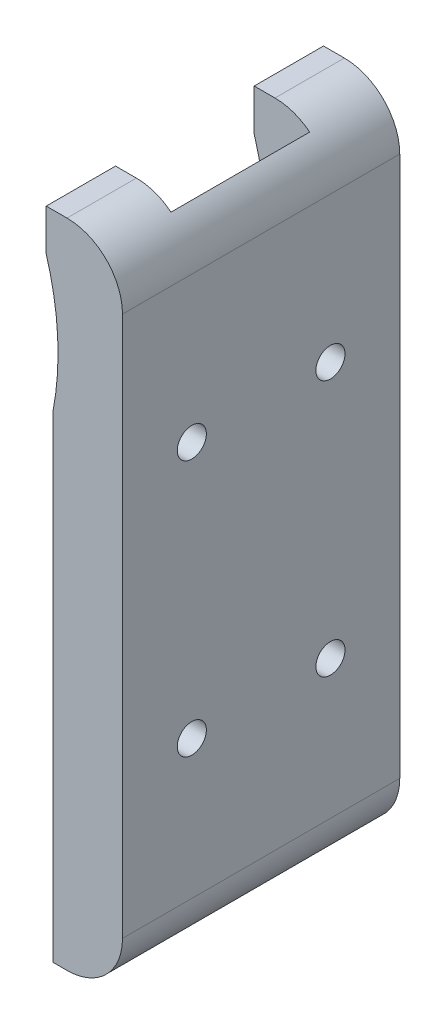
ISO-10303-21;
HEADER;
FILE_DESCRIPTION(('STEP AP214'),'2;1');
FILE_NAME('part.step','',(''),(''),'','','');
FILE_SCHEMA(('AUTOMOTIVE_DESIGN { 1 0 10303 214 1 1 1 1 }'));
ENDSEC;
DATA;
#1=APPLICATION_CONTEXT('core data for automotive mechanical design processes');
#2=APPLICATION_PROTOCOL_DEFINITION('international standard','automotive_design',2000,#1);
#3=PRODUCT_CONTEXT('',#1,'mechanical');
#4=PRODUCT('Part','Part','',(#3));
#5=PRODUCT_RELATED_PRODUCT_CATEGORY('part','',(#4));
#6=PRODUCT_DEFINITION_FORMATION('','',#4);
#7=PRODUCT_DEFINITION_CONTEXT('part definition',#1,'design');
#8=PRODUCT_DEFINITION('design','',#6,#7);
#9=PRODUCT_DEFINITION_SHAPE('','',#8);
#10=(LENGTH_UNIT() NAMED_UNIT(*) SI_UNIT(.MILLI.,.METRE.));
#11=(NAMED_UNIT(*) PLANE_ANGLE_UNIT() SI_UNIT($,.RADIAN.));
#12=(NAMED_UNIT(*) SI_UNIT($,.STERADIAN.) SOLID_ANGLE_UNIT());
#13=UNCERTAINTY_MEASURE_WITH_UNIT(LENGTH_MEASURE(1.E-05),#10,'distance_accuracy_value','');
#14=(GEOMETRIC_REPRESENTATION_CONTEXT(3) GLOBAL_UNCERTAINTY_ASSIGNED_CONTEXT((#13)) GLOBAL_UNIT_ASSIGNED_CONTEXT((#10,
#11,#12)) REPRESENTATION_CONTEXT('',''));
#15=CARTESIAN_POINT('',(0.,0.,0.));
#16=DIRECTION('',(0.,0.,1.));
#17=DIRECTION('',(1.,0.,0.));
#18=AXIS2_PLACEMENT_3D('',#15,#16,#17);
#19=CARTESIAN_POINT('',(17.,95.,10.));
#20=DIRECTION('',(0.,0.,1.));
#21=DIRECTION('',(0.,-1.,0.));
#22=AXIS2_PLACEMENT_3D('',#19,#20,#21);
#23=PLANE('',#22);
#24=DIRECTION('',(0.,1.,0.));
#25=VECTOR('',#24,1.);
#26=CARTESIAN_POINT('',(10.,164.,10.));
#27=LINE('',#26,#25);
#28=CARTESIAN_POINT('',(10.,95.,10.));
#29=VERTEX_POINT('',#28);
#30=CARTESIAN_POINT('',(10.,120.9,10.));
#31=VERTEX_POINT('',#30);
#32=EDGE_CURVE('E531',#29,#31,#27,.T.);
#33=ORIENTED_EDGE('',*,*,#32,.T.);
#34=DIRECTION('',(1.,0.,0.));
#35=VECTOR('',#34,1.);
#36=CARTESIAN_POINT('',(20.,120.9,10.));
#37=LINE('',#36,#35);
#38=CARTESIAN_POINT('',(17.,120.9,10.));
#39=VERTEX_POINT('',#38);
#40=EDGE_CURVE('E520',#31,#39,#37,.T.);
#41=ORIENTED_EDGE('',*,*,#40,.T.);
#42=DIRECTION('',(0.,1.,0.));
#43=VECTOR('',#42,1.);
#44=CARTESIAN_POINT('',(17.,95.,10.));
#45=LINE('',#44,#43);
#46=CARTESIAN_POINT('',(17.,96.7550020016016,10.));
#47=VERTEX_POINT('',#46);
#48=EDGE_CURVE('E528',#47,#39,#45,.T.);
#49=ORIENTED_EDGE('',*,*,#48,.F.);
#50=CARTESIAN_POINT('',(12.,103.,10.));
#51=DIRECTION('',(0.,0.,1.));
#52=DIRECTION('',(0.,-1.,0.));
#53=AXIS2_PLACEMENT_3D('',#50,#51,#52);
#54=CIRCLE('',#53,8.00000000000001);
#55=CARTESIAN_POINT('',(12.,95.,10.));
#56=VERTEX_POINT('',#55);
#57=EDGE_CURVE('E716',#47,#56,#54,.F.);
#58=ORIENTED_EDGE('',*,*,#57,.T.);
#59=DIRECTION('',(-1.,0.,0.));
#60=VECTOR('',#59,1.);
#61=CARTESIAN_POINT('',(12.,95.,10.));
#62=LINE('',#61,#60);
#63=EDGE_CURVE('E677',#56,#29,#62,.T.);
#64=ORIENTED_EDGE('',*,*,#63,.T.);
#65=EDGE_LOOP('',(#33,#41,#49,#58,#64));
#66=FACE_BOUND('',#65,.T.);
#67=ADVANCED_FACE('F359',(#66),#23,.F.);
#68=CARTESIAN_POINT('',(17.,125.1,10.));
#69=VERTEX_POINT('',#68);
#70=CARTESIAN_POINT('',(17.,157.9,10.));
#71=VERTEX_POINT('',#70);
#72=EDGE_CURVE('E538',#69,#71,#45,.T.);
#73=ORIENTED_EDGE('',*,*,#72,.F.);
#74=DIRECTION('',(1.,0.,0.));
#75=VECTOR('',#74,1.);
#76=CARTESIAN_POINT('',(20.,125.1,10.));
#77=LINE('',#76,#75);
#78=CARTESIAN_POINT('',(10.,125.1,10.));
#79=VERTEX_POINT('',#78);
#80=EDGE_CURVE('E374',#69,#79,#77,.F.);
#81=ORIENTED_EDGE('',*,*,#80,.T.);
#82=CARTESIAN_POINT('',(10.,157.9,10.));
#83=VERTEX_POINT('',#82);
#84=EDGE_CURVE('E734',#79,#83,#27,.T.);
#85=ORIENTED_EDGE('',*,*,#84,.T.);
#86=DIRECTION('',(1.,0.,0.));
#87=VECTOR('',#86,1.);
#88=CARTESIAN_POINT('',(20.,157.9,10.));
#89=LINE('',#88,#87);
#90=EDGE_CURVE('E588',#83,#71,#89,.T.);
#91=ORIENTED_EDGE('',*,*,#90,.T.);
#92=EDGE_LOOP('',(#73,#81,#85,#91));
#93=FACE_BOUND('',#92,.T.);
#94=ADVANCED_FACE('F806',(#93),#23,.F.);
#95=CARTESIAN_POINT('',(17.,95.,-9.99999999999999));
#96=DIRECTION('',(0.,0.,-1.));
#97=DIRECTION('',(0.,1.,0.));
#98=AXIS2_PLACEMENT_3D('',#95,#96,#97);
#99=PLANE('',#98);
#100=DIRECTION('',(0.,-1.,0.));
#101=VECTOR('',#100,1.);
#102=CARTESIAN_POINT('',(10.,164.,-10.));
#103=LINE('',#102,#101);
#104=CARTESIAN_POINT('',(9.99999999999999,164.,-10.));
#105=VERTEX_POINT('',#104);
#106=CARTESIAN_POINT('',(10.,162.1,-10.));
#107=VERTEX_POINT('',#106);
#108=EDGE_CURVE('E721',#105,#107,#103,.T.);
#109=ORIENTED_EDGE('',*,*,#108,.T.);
#110=DIRECTION('',(1.,0.,0.));
#111=VECTOR('',#110,1.);
#112=CARTESIAN_POINT('',(20.,162.1,-10.));
#113=LINE('',#112,#111);
#114=CARTESIAN_POINT('',(17.,162.1,-10.));
#115=VERTEX_POINT('',#114);
#116=EDGE_CURVE('E577',#107,#115,#113,.T.);
#117=ORIENTED_EDGE('',*,*,#116,.T.);
#118=DIRECTION('',(0.,-1.,0.));
#119=VECTOR('',#118,1.);
#120=CARTESIAN_POINT('',(17.,95.,-9.99999999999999));
#121=LINE('',#120,#119);
#122=CARTESIAN_POINT('',(17.,187.244997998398,-10.));
#123=VERTEX_POINT('',#122);
#124=EDGE_CURVE('E546',#123,#115,#121,.T.);
#125=ORIENTED_EDGE('',*,*,#124,.F.);
#126=CARTESIAN_POINT('',(12.,181.,-10.));
#127=DIRECTION('',(0.,0.,-1.));
#128=DIRECTION('',(0.,1.,0.));
#129=AXIS2_PLACEMENT_3D('',#126,#127,#128);
#130=CIRCLE('',#129,8.00000000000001);
#131=CARTESIAN_POINT('',(12.,189.,-10.));
#132=VERTEX_POINT('',#131);
#133=EDGE_CURVE('E720',#123,#132,#130,.F.);
#134=ORIENTED_EDGE('',*,*,#133,.T.);
#135=DIRECTION('',(-1.,0.,0.));
#136=VECTOR('',#135,1.);
#137=CARTESIAN_POINT('',(17.,189.,-10.));
#138=LINE('',#137,#136);
#139=CARTESIAN_POINT('',(9.00000000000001,189.,-10.));
#140=VERTEX_POINT('',#139);
#141=EDGE_CURVE('E542',#132,#140,#138,.T.);
#142=ORIENTED_EDGE('',*,*,#141,.T.);
#143=DIRECTION('',(0.,-1.,0.));
#144=VECTOR('',#143,1.);
#145=CARTESIAN_POINT('',(9.00000000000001,95.,-9.99999999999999));
#146=LINE('',#145,#144);
#147=CARTESIAN_POINT('',(9.00000000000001,183.,-10.));
#148=VERTEX_POINT('',#147);
#149=EDGE_CURVE('E559',#140,#148,#146,.T.);
#150=ORIENTED_EDGE('',*,*,#149,.T.);
#151=CARTESIAN_POINT('',(-29.2985838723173,171.457969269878,-10.));
#152=DIRECTION('',(0.,0.,-1.));
#153=DIRECTION('',(0.,1.,0.));
#154=AXIS2_PLACEMENT_3D('',#151,#152,#153);
#155=CIRCLE('',#154,40.);
#156=EDGE_CURVE('E728',#148,#105,#155,.T.);
#157=ORIENTED_EDGE('',*,*,#156,.T.);
#158=EDGE_LOOP('',(#109,#117,#125,#134,#142,#150,#157));
#159=FACE_BOUND('',#158,.T.);
#160=ADVANCED_FACE('F740',(#159),#99,.F.);
#161=CARTESIAN_POINT('',(17.,157.9,-10.));
#162=VERTEX_POINT('',#161);
#163=CARTESIAN_POINT('',(17.,125.1,-9.99999999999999));
#164=VERTEX_POINT('',#163);
#165=EDGE_CURVE('E550',#162,#164,#121,.T.);
#166=ORIENTED_EDGE('',*,*,#165,.F.);
#167=DIRECTION('',(1.,0.,0.));
#168=VECTOR('',#167,1.);
#169=CARTESIAN_POINT('',(20.,157.9,-10.));
#170=LINE('',#169,#168);
#171=CARTESIAN_POINT('',(10.,157.9,-10.));
#172=VERTEX_POINT('',#171);
#173=EDGE_CURVE('E580',#162,#172,#170,.F.);
#174=ORIENTED_EDGE('',*,*,#173,.T.);
#175=CARTESIAN_POINT('',(10.,125.1,-9.99999999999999));
#176=VERTEX_POINT('',#175);
#177=EDGE_CURVE('E724',#172,#176,#103,.T.);
#178=ORIENTED_EDGE('',*,*,#177,.T.);
#179=DIRECTION('',(1.,0.,0.));
#180=VECTOR('',#179,1.);
#181=CARTESIAN_POINT('',(20.,125.1,-9.99999999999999));
#182=LINE('',#181,#180);
#183=EDGE_CURVE('E566',#176,#164,#182,.T.);
#184=ORIENTED_EDGE('',*,*,#183,.T.);
#185=EDGE_LOOP('',(#166,#174,#178,#184));
#186=FACE_BOUND('',#185,.T.);
#187=ADVANCED_FACE('F799',(#186),#99,.F.);
#188=CARTESIAN_POINT('',(10.,164.,-20.));
#189=DIRECTION('',(-1.,0.,0.));
#190=DIRECTION('',(0.,-1.,0.));
#191=AXIS2_PLACEMENT_3D('',#188,#189,#190);
#192=PLANE('',#191);
#193=CARTESIAN_POINT('',(10.,160.,-10.));
#194=DIRECTION('',(-1.,0.,0.));
#195=DIRECTION('',(0.,-1.,0.));
#196=AXIS2_PLACEMENT_3D('',#193,#194,#195);
#197=CIRCLE('',#196,2.09999999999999);
#198=EDGE_CURVE('E575',#107,#172,#197,.T.);
#199=ORIENTED_EDGE('',*,*,#198,.F.);
#200=ORIENTED_EDGE('',*,*,#108,.F.);
#201=DIRECTION('',(0.,0.,1.));
#202=VECTOR('',#201,1.);
#203=CARTESIAN_POINT('',(10.,164.,-20.));
#204=LINE('',#203,#202);
#205=CARTESIAN_POINT('',(10.,164.,-20.));
#206=VERTEX_POINT('',#205);
#207=EDGE_CURVE('E674',#206,#105,#204,.T.);
#208=ORIENTED_EDGE('',*,*,#207,.F.);
#209=DIRECTION('',(0.,-1.,0.));
#210=VECTOR('',#209,1.);
#211=CARTESIAN_POINT('',(10.,164.,-20.));
#212=LINE('',#211,#210);
#213=CARTESIAN_POINT('',(10.,95.,-20.));
#214=VERTEX_POINT('',#213);
#215=EDGE_CURVE('E650',#206,#214,#212,.T.);
#216=ORIENTED_EDGE('',*,*,#215,.T.);
#217=DIRECTION('',(0.,0.,1.));
#218=VECTOR('',#217,1.);
#219=CARTESIAN_POINT('',(10.,95.,-20.));
#220=LINE('',#219,#218);
#221=CARTESIAN_POINT('',(10.,95.,-9.99999999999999));
#222=VERTEX_POINT('',#221);
#223=EDGE_CURVE('E697',#214,#222,#220,.T.);
#224=ORIENTED_EDGE('',*,*,#223,.T.);
#225=CARTESIAN_POINT('',(10.,120.9,-9.99999999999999));
#226=VERTEX_POINT('',#225);
#227=EDGE_CURVE('E726',#226,#222,#103,.T.);
#228=ORIENTED_EDGE('',*,*,#227,.F.);
#229=CARTESIAN_POINT('',(10.,123.,-10.));
#230=DIRECTION('',(-1.,0.,0.));
#231=DIRECTION('',(0.,-1.,0.));
#232=AXIS2_PLACEMENT_3D('',#229,#230,#231);
#233=CIRCLE('',#232,2.09999999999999);
#234=EDGE_CURVE('E562',#176,#226,#233,.T.);
#235=ORIENTED_EDGE('',*,*,#234,.F.);
#236=ORIENTED_EDGE('',*,*,#177,.F.);
#237=EDGE_LOOP('',(#199,#200,#208,#216,#224,#228,#235,#236));
#238=FACE_BOUND('',#237,.T.);
#239=ADVANCED_FACE('F781',(#238),#192,.T.);
#240=CARTESIAN_POINT('',(-29.2985838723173,171.457969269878,-20.));
#241=DIRECTION('',(0.,0.,1.));
#242=DIRECTION('',(1.,0.,0.));
#243=AXIS2_PLACEMENT_3D('',#240,#241,#242);
#244=CYLINDRICAL_SURFACE('',#243,40.);
#245=ORIENTED_EDGE('',*,*,#156,.F.);
#246=DIRECTION('',(0.,0.,1.));
#247=VECTOR('',#246,1.);
#248=CARTESIAN_POINT('',(9.00000000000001,183.,-20.));
#249=LINE('',#248,#247);
#250=CARTESIAN_POINT('',(9.00000000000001,183.,-20.));
#251=VERTEX_POINT('',#250);
#252=EDGE_CURVE('E679',#251,#148,#249,.T.);
#253=ORIENTED_EDGE('',*,*,#252,.F.);
#254=CARTESIAN_POINT('',(-29.2985838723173,171.457969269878,-20.));
#255=DIRECTION('',(0.,0.,-1.));
#256=DIRECTION('',(1.,0.,0.));
#257=AXIS2_PLACEMENT_3D('',#254,#255,#256);
#258=CIRCLE('',#257,40.);
#259=EDGE_CURVE('E670',#251,#206,#258,.T.);
#260=ORIENTED_EDGE('',*,*,#259,.T.);
#261=ORIENTED_EDGE('',*,*,#207,.T.);
#262=EDGE_LOOP('',(#245,#253,#260,#261));
#263=FACE_BOUND('',#262,.T.);
#264=ADVANCED_FACE('F785',(#263),#244,.F.);
#265=CARTESIAN_POINT('',(9.00000000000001,189.,-20.));
#266=DIRECTION('',(-1.,0.,0.));
#267=DIRECTION('',(0.,0.,1.));
#268=AXIS2_PLACEMENT_3D('',#265,#266,#267);
#269=PLANE('',#268);
#270=ORIENTED_EDGE('',*,*,#149,.F.);
#271=DIRECTION('',(0.,0.,1.));
#272=VECTOR('',#271,1.);
#273=CARTESIAN_POINT('',(9.00000000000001,189.,-20.));
#274=LINE('',#273,#272);
#275=CARTESIAN_POINT('',(9.00000000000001,189.,-20.));
#276=VERTEX_POINT('',#275);
#277=EDGE_CURVE('E683',#276,#140,#274,.T.);
#278=ORIENTED_EDGE('',*,*,#277,.F.);
#279=DIRECTION('',(0.,-1.,0.));
#280=VECTOR('',#279,1.);
#281=CARTESIAN_POINT('',(9.00000000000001,189.,-20.));
#282=LINE('',#281,#280);
#283=EDGE_CURVE('E667',#276,#251,#282,.T.);
#284=ORIENTED_EDGE('',*,*,#283,.T.);
#285=ORIENTED_EDGE('',*,*,#252,.T.);
#286=EDGE_LOOP('',(#270,#278,#284,#285));
#287=FACE_BOUND('',#286,.T.);
#288=ADVANCED_FACE('F744',(#287),#269,.T.);
#289=CARTESIAN_POINT('',(12.,189.,-20.));
#290=DIRECTION('',(0.,1.,0.));
#291=DIRECTION('',(0.,0.,1.));
#292=AXIS2_PLACEMENT_3D('',#289,#290,#291);
#293=PLANE('',#292);
#294=ORIENTED_EDGE('',*,*,#141,.F.);
#295=DIRECTION('',(0.,0.,1.));
#296=VECTOR('',#295,1.);
#297=CARTESIAN_POINT('',(12.,189.,-20.));
#298=LINE('',#297,#296);
#299=CARTESIAN_POINT('',(12.,189.,-20.));
#300=VERTEX_POINT('',#299);
#301=EDGE_CURVE('E687',#300,#132,#298,.T.);
#302=ORIENTED_EDGE('',*,*,#301,.F.);
#303=DIRECTION('',(-1.,0.,0.));
#304=VECTOR('',#303,1.);
#305=CARTESIAN_POINT('',(12.,189.,-20.));
#306=LINE('',#305,#304);
#307=EDGE_CURVE('E664',#300,#276,#306,.T.);
#308=ORIENTED_EDGE('',*,*,#307,.T.);
#309=ORIENTED_EDGE('',*,*,#277,.T.);
#310=EDGE_LOOP('',(#294,#302,#308,#309));
#311=FACE_BOUND('',#310,.T.);
#312=ADVANCED_FACE('F746',(#311),#293,.T.);
#313=CARTESIAN_POINT('',(12.,95.,-20.));
#314=DIRECTION('',(0.,-1.,0.));
#315=DIRECTION('',(0.,0.,-1.));
#316=AXIS2_PLACEMENT_3D('',#313,#314,#315);
#317=PLANE('',#316);
#318=DIRECTION('',(1.,0.,0.));
#319=VECTOR('',#318,1.);
#320=CARTESIAN_POINT('',(12.,95.,-9.99999999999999));
#321=LINE('',#320,#319);
#322=CARTESIAN_POINT('',(12.,95.,-9.99999999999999));
#323=VERTEX_POINT('',#322);
#324=EDGE_CURVE('E701',#222,#323,#321,.T.);
#325=ORIENTED_EDGE('',*,*,#324,.F.);
#326=ORIENTED_EDGE('',*,*,#223,.F.);
#327=DIRECTION('',(1.,0.,0.));
#328=VECTOR('',#327,1.);
#329=CARTESIAN_POINT('',(12.,95.,-20.));
#330=LINE('',#329,#328);
#331=CARTESIAN_POINT('',(12.,95.,-20.));
#332=VERTEX_POINT('',#331);
#333=EDGE_CURVE('E653',#214,#332,#330,.T.);
#334=ORIENTED_EDGE('',*,*,#333,.T.);
#335=DIRECTION('',(0.,0.,1.));
#336=VECTOR('',#335,1.);
#337=CARTESIAN_POINT('',(12.,95.,-20.));
#338=LINE('',#337,#336);
#339=EDGE_CURVE('E693',#332,#323,#338,.T.);
#340=ORIENTED_EDGE('',*,*,#339,.T.);
#341=EDGE_LOOP('',(#325,#326,#334,#340));
#342=FACE_BOUND('',#341,.T.);
#343=ADVANCED_FACE('F777',(#342),#317,.T.);
#344=CARTESIAN_POINT('',(10.,123.,10.));
#345=DIRECTION('',(-1.,0.,0.));
#346=DIRECTION('',(0.,-1.,0.));
#347=AXIS2_PLACEMENT_3D('',#344,#345,#346);
#348=CIRCLE('',#347,2.09999999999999);
#349=EDGE_CURVE('E532',#31,#79,#348,.T.);
#350=ORIENTED_EDGE('',*,*,#349,.F.);
#351=ORIENTED_EDGE('',*,*,#32,.F.);
#352=CARTESIAN_POINT('',(10.,95.,20.));
#353=VERTEX_POINT('',#352);
#354=EDGE_CURVE('E673',#29,#353,#220,.T.);
#355=ORIENTED_EDGE('',*,*,#354,.T.);
#356=DIRECTION('',(0.,-1.,0.));
#357=VECTOR('',#356,1.);
#358=CARTESIAN_POINT('',(10.,164.,20.));
#359=LINE('',#358,#357);
#360=CARTESIAN_POINT('',(10.,164.,20.));
#361=VERTEX_POINT('',#360);
#362=EDGE_CURVE('E636',#361,#353,#359,.T.);
#363=ORIENTED_EDGE('',*,*,#362,.F.);
#364=CARTESIAN_POINT('',(9.99999999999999,164.,10.));
#365=VERTEX_POINT('',#364);
#366=EDGE_CURVE('E678',#365,#361,#204,.T.);
#367=ORIENTED_EDGE('',*,*,#366,.F.);
#368=CARTESIAN_POINT('',(10.,162.1,10.));
#369=VERTEX_POINT('',#368);
#370=EDGE_CURVE('E735',#369,#365,#27,.T.);
#371=ORIENTED_EDGE('',*,*,#370,.F.);
#372=CARTESIAN_POINT('',(10.,160.,10.));
#373=DIRECTION('',(-1.,0.,0.));
#374=DIRECTION('',(0.,-1.,0.));
#375=AXIS2_PLACEMENT_3D('',#372,#373,#374);
#376=CIRCLE('',#375,2.09999999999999);
#377=EDGE_CURVE('E586',#83,#369,#376,.T.);
#378=ORIENTED_EDGE('',*,*,#377,.F.);
#379=ORIENTED_EDGE('',*,*,#84,.F.);
#380=EDGE_LOOP('',(#350,#351,#355,#363,#367,#371,#378,#379));
#381=FACE_BOUND('',#380,.T.);
#382=ADVANCED_FACE('F361',(#381),#192,.T.);
#383=CARTESIAN_POINT('',(-29.2985838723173,171.457969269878,10.));
#384=DIRECTION('',(0.,0.,1.));
#385=DIRECTION('',(0.,-1.,0.));
#386=AXIS2_PLACEMENT_3D('',#383,#384,#385);
#387=CIRCLE('',#386,40.);
#388=CARTESIAN_POINT('',(9.00000000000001,183.,10.));
#389=VERTEX_POINT('',#388);
#390=EDGE_CURVE('E715',#365,#389,#387,.T.);
#391=ORIENTED_EDGE('',*,*,#390,.F.);
#392=ORIENTED_EDGE('',*,*,#366,.T.);
#393=CARTESIAN_POINT('',(-29.2985838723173,171.457969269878,20.));
#394=DIRECTION('',(0.,0.,-1.));
#395=DIRECTION('',(1.,0.,0.));
#396=AXIS2_PLACEMENT_3D('',#393,#394,#395);
#397=CIRCLE('',#396,40.);
#398=CARTESIAN_POINT('',(9.00000000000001,183.,20.));
#399=VERTEX_POINT('',#398);
#400=EDGE_CURVE('E647',#399,#361,#397,.T.);
#401=ORIENTED_EDGE('',*,*,#400,.F.);
#402=EDGE_CURVE('E682',#389,#399,#249,.T.);
#403=ORIENTED_EDGE('',*,*,#402,.F.);
#404=EDGE_LOOP('',(#391,#392,#401,#403));
#405=FACE_BOUND('',#404,.T.);
#406=ADVANCED_FACE('F764',(#405),#244,.F.);
#407=DIRECTION('',(0.,1.,0.));
#408=VECTOR('',#407,1.);
#409=CARTESIAN_POINT('',(9.00000000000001,95.,10.));
#410=LINE('',#409,#408);
#411=CARTESIAN_POINT('',(9.00000000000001,189.,10.));
#412=VERTEX_POINT('',#411);
#413=EDGE_CURVE('E555',#389,#412,#410,.T.);
#414=ORIENTED_EDGE('',*,*,#413,.F.);
#415=ORIENTED_EDGE('',*,*,#402,.T.);
#416=DIRECTION('',(0.,-1.,0.));
#417=VECTOR('',#416,1.);
#418=CARTESIAN_POINT('',(9.00000000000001,189.,20.));
#419=LINE('',#418,#417);
#420=CARTESIAN_POINT('',(9.00000000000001,189.,20.));
#421=VERTEX_POINT('',#420);
#422=EDGE_CURVE('E644',#421,#399,#419,.T.);
#423=ORIENTED_EDGE('',*,*,#422,.F.);
#424=EDGE_CURVE('E686',#412,#421,#274,.T.);
#425=ORIENTED_EDGE('',*,*,#424,.F.);
#426=EDGE_LOOP('',(#414,#415,#423,#425));
#427=FACE_BOUND('',#426,.T.);
#428=ADVANCED_FACE('F760',(#427),#269,.T.);
#429=DIRECTION('',(-1.,0.,0.));
#430=VECTOR('',#429,1.);
#431=CARTESIAN_POINT('',(17.,189.,10.));
#432=LINE('',#431,#430);
#433=CARTESIAN_POINT('',(12.,189.,10.));
#434=VERTEX_POINT('',#433);
#435=EDGE_CURVE('E537',#434,#412,#432,.T.);
#436=ORIENTED_EDGE('',*,*,#435,.T.);
#437=ORIENTED_EDGE('',*,*,#424,.T.);
#438=DIRECTION('',(-1.,0.,0.));
#439=VECTOR('',#438,1.);
#440=CARTESIAN_POINT('',(12.,189.,20.));
#441=LINE('',#440,#439);
#442=CARTESIAN_POINT('',(12.,189.,20.));
#443=VERTEX_POINT('',#442);
#444=EDGE_CURVE('E641',#443,#421,#441,.T.);
#445=ORIENTED_EDGE('',*,*,#444,.F.);
#446=EDGE_CURVE('E690',#434,#443,#298,.T.);
#447=ORIENTED_EDGE('',*,*,#446,.F.);
#448=EDGE_LOOP('',(#436,#437,#445,#447));
#449=FACE_BOUND('',#448,.T.);
#450=ADVANCED_FACE('F757',(#449),#293,.T.);
#451=CARTESIAN_POINT('',(12.,181.,-20.));
#452=DIRECTION('',(0.,0.,1.));
#453=DIRECTION('',(1.,0.,0.));
#454=AXIS2_PLACEMENT_3D('',#451,#452,#453);
#455=CYLINDRICAL_SURFACE('',#454,8.00000000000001);
#456=ORIENTED_EDGE('',*,*,#133,.F.);
#457=DIRECTION('',(0.,0.,1.));
#458=VECTOR('',#457,1.);
#459=CARTESIAN_POINT('',(17.,187.244997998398,-20.));
#460=LINE('',#459,#458);
#461=CARTESIAN_POINT('',(17.,187.244997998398,10.));
#462=VERTEX_POINT('',#461);
#463=EDGE_CURVE('E719',#462,#123,#460,.F.);
#464=ORIENTED_EDGE('',*,*,#463,.F.);
#465=CARTESIAN_POINT('',(12.,181.,10.));
#466=DIRECTION('',(0.,0.,1.));
#467=DIRECTION('',(0.,-1.,0.));
#468=AXIS2_PLACEMENT_3D('',#465,#466,#467);
#469=CIRCLE('',#468,8.00000000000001);
#470=EDGE_CURVE('E711',#434,#462,#469,.F.);
#471=ORIENTED_EDGE('',*,*,#470,.F.);
#472=ORIENTED_EDGE('',*,*,#446,.T.);
#473=CARTESIAN_POINT('',(12.,181.,20.));
#474=DIRECTION('',(0.,0.,1.));
#475=DIRECTION('',(-1.,0.,0.));
#476=AXIS2_PLACEMENT_3D('',#473,#474,#475);
#477=CIRCLE('',#476,8.00000000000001);
#478=CARTESIAN_POINT('',(20.,181.,20.));
#479=VERTEX_POINT('',#478);
#480=EDGE_CURVE('E624',#479,#443,#477,.T.);
#481=ORIENTED_EDGE('',*,*,#480,.F.);
#482=DIRECTION('',(0.,0.,1.));
#483=VECTOR('',#482,1.);
#484=CARTESIAN_POINT('',(20.,181.,-20.));
#485=LINE('',#484,#483);
#486=CARTESIAN_POINT('',(20.,181.,-20.));
#487=VERTEX_POINT('',#486);
#488=EDGE_CURVE('E620',#487,#479,#485,.T.);
#489=ORIENTED_EDGE('',*,*,#488,.F.);
#490=CARTESIAN_POINT('',(12.,181.,-20.));
#491=DIRECTION('',(0.,0.,1.));
#492=DIRECTION('',(-1.,0.,0.));
#493=AXIS2_PLACEMENT_3D('',#490,#491,#492);
#494=CIRCLE('',#493,8.00000000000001);
#495=EDGE_CURVE('E661',#487,#300,#494,.T.);
#496=ORIENTED_EDGE('',*,*,#495,.T.);
#497=ORIENTED_EDGE('',*,*,#301,.T.);
#498=EDGE_LOOP('',(#456,#464,#471,#472,#481,#489,#496,#497));
#499=FACE_BOUND('',#498,.T.);
#500=ADVANCED_FACE('F605',(#499),#455,.T.);
#501=CARTESIAN_POINT('',(20.,181.,-20.));
#502=DIRECTION('',(1.,0.,0.));
#503=DIRECTION('',(0.,1.,0.));
#504=AXIS2_PLACEMENT_3D('',#501,#502,#503);
#505=PLANE('',#504);
#506=CARTESIAN_POINT('',(20.,123.,10.));
#507=DIRECTION('',(1.,0.,0.));
#508=DIRECTION('',(0.,0.,-1.));
#509=AXIS2_PLACEMENT_3D('',#506,#507,#508);
#510=CIRCLE('',#509,2.09999999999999);
#511=CARTESIAN_POINT('',(20.,123.,7.90000000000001));
#512=VERTEX_POINT('',#511);
#513=EDGE_CURVE('E597',#512,#512,#510,.T.);
#514=ORIENTED_EDGE('',*,*,#513,.F.);
#515=EDGE_LOOP('',(#514));
#516=FACE_BOUND('',#515,.T.);
#517=CARTESIAN_POINT('',(20.,160.,10.));
#518=DIRECTION('',(1.,0.,0.));
#519=DIRECTION('',(0.,0.,-1.));
#520=AXIS2_PLACEMENT_3D('',#517,#518,#519);
#521=CIRCLE('',#520,2.09999999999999);
#522=CARTESIAN_POINT('',(20.,160.,7.90000000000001));
#523=VERTEX_POINT('',#522);
#524=EDGE_CURVE('E592',#523,#523,#521,.T.);
#525=ORIENTED_EDGE('',*,*,#524,.F.);
#526=EDGE_LOOP('',(#525));
#527=FACE_BOUND('',#526,.T.);
#528=CARTESIAN_POINT('',(20.,160.,-10.));
#529=DIRECTION('',(1.,0.,0.));
#530=DIRECTION('',(0.,0.,-1.));
#531=AXIS2_PLACEMENT_3D('',#528,#529,#530);
#532=CIRCLE('',#531,2.09999999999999);
#533=CARTESIAN_POINT('',(20.,160.,-12.1));
#534=VERTEX_POINT('',#533);
#535=EDGE_CURVE('E583',#534,#534,#532,.T.);
#536=ORIENTED_EDGE('',*,*,#535,.F.);
#537=EDGE_LOOP('',(#536));
#538=FACE_BOUND('',#537,.T.);
#539=CARTESIAN_POINT('',(20.,123.,-10.));
#540=DIRECTION('',(1.,0.,0.));
#541=DIRECTION('',(0.,0.,-1.));
#542=AXIS2_PLACEMENT_3D('',#539,#540,#541);
#543=CIRCLE('',#542,2.09999999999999);
#544=CARTESIAN_POINT('',(20.,123.,-12.1));
#545=VERTEX_POINT('',#544);
#546=EDGE_CURVE('E572',#545,#545,#543,.T.);
#547=ORIENTED_EDGE('',*,*,#546,.F.);
#548=EDGE_LOOP('',(#547));
#549=FACE_BOUND('',#548,.T.);
#550=DIRECTION('',(0.,1.,0.));
#551=VECTOR('',#550,1.);
#552=CARTESIAN_POINT('',(20.,181.,20.));
#553=LINE('',#552,#551);
#554=CARTESIAN_POINT('',(20.,103.,20.));
#555=VERTEX_POINT('',#554);
#556=EDGE_CURVE('E615',#555,#479,#553,.T.);
#557=ORIENTED_EDGE('',*,*,#556,.F.);
#558=DIRECTION('',(0.,0.,1.));
#559=VECTOR('',#558,1.);
#560=CARTESIAN_POINT('',(20.,103.,-20.));
#561=LINE('',#560,#559);
#562=CARTESIAN_POINT('',(20.,103.,-20.));
#563=VERTEX_POINT('',#562);
#564=EDGE_CURVE('E618',#563,#555,#561,.T.);
#565=ORIENTED_EDGE('',*,*,#564,.F.);
#566=DIRECTION('',(0.,1.,0.));
#567=VECTOR('',#566,1.);
#568=CARTESIAN_POINT('',(20.,181.,-20.));
#569=LINE('',#568,#567);
#570=EDGE_CURVE('E659',#563,#487,#569,.T.);
#571=ORIENTED_EDGE('',*,*,#570,.T.);
#572=ORIENTED_EDGE('',*,*,#488,.T.);
#573=EDGE_LOOP('',(#557,#565,#571,#572));
#574=FACE_BOUND('',#573,.T.);
#575=ADVANCED_FACE('F601',(#516,#527,#538,#549,#574),#505,.T.);
#576=CARTESIAN_POINT('',(12.,103.,-20.));
#577=DIRECTION('',(0.,0.,1.));
#578=DIRECTION('',(1.,0.,0.));
#579=AXIS2_PLACEMENT_3D('',#576,#577,#578);
#580=CYLINDRICAL_SURFACE('',#579,8.00000000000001);
#581=CARTESIAN_POINT('',(12.,103.,-9.99999999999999));
#582=DIRECTION('',(0.,0.,-1.));
#583=DIRECTION('',(0.,1.,0.));
#584=AXIS2_PLACEMENT_3D('',#581,#582,#583);
#585=CIRCLE('',#584,8.00000000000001);
#586=CARTESIAN_POINT('',(17.,96.7550020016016,-9.99999999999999));
#587=VERTEX_POINT('',#586);
#588=EDGE_CURVE('E731',#323,#587,#585,.F.);
#589=ORIENTED_EDGE('',*,*,#588,.F.);
#590=ORIENTED_EDGE('',*,*,#339,.F.);
#591=CARTESIAN_POINT('',(12.,103.,-20.));
#592=DIRECTION('',(0.,0.,1.));
#593=DIRECTION('',(-1.,0.,0.));
#594=AXIS2_PLACEMENT_3D('',#591,#592,#593);
#595=CIRCLE('',#594,8.00000000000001);
#596=EDGE_CURVE('E656',#332,#563,#595,.T.);
#597=ORIENTED_EDGE('',*,*,#596,.T.);
#598=ORIENTED_EDGE('',*,*,#564,.T.);
#599=CARTESIAN_POINT('',(12.,103.,20.));
#600=DIRECTION('',(0.,0.,1.));
#601=DIRECTION('',(-1.,0.,0.));
#602=AXIS2_PLACEMENT_3D('',#599,#600,#601);
#603=CIRCLE('',#602,8.00000000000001);
#604=CARTESIAN_POINT('',(12.,95.,20.));
#605=VERTEX_POINT('',#604);
#606=EDGE_CURVE('E625',#605,#555,#603,.T.);
#607=ORIENTED_EDGE('',*,*,#606,.F.);
#608=EDGE_CURVE('E696',#56,#605,#338,.T.);
#609=ORIENTED_EDGE('',*,*,#608,.F.);
#610=ORIENTED_EDGE('',*,*,#57,.F.);
#611=DIRECTION('',(0.,0.,1.));
#612=VECTOR('',#611,1.);
#613=CARTESIAN_POINT('',(17.,96.7550020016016,-20.));
#614=LINE('',#613,#612);
#615=EDGE_CURVE('E536',#587,#47,#614,.T.);
#616=ORIENTED_EDGE('',*,*,#615,.F.);
#617=EDGE_LOOP('',(#589,#590,#597,#598,#607,#609,#610,#616));
#618=FACE_BOUND('',#617,.T.);
#619=ADVANCED_FACE('F604',(#618),#580,.T.);
#620=ORIENTED_EDGE('',*,*,#63,.F.);
#621=ORIENTED_EDGE('',*,*,#608,.T.);
#622=DIRECTION('',(1.,0.,0.));
#623=VECTOR('',#622,1.);
#624=CARTESIAN_POINT('',(12.,95.,20.));
#625=LINE('',#624,#623);
#626=EDGE_CURVE('E632',#353,#605,#625,.T.);
#627=ORIENTED_EDGE('',*,*,#626,.F.);
#628=ORIENTED_EDGE('',*,*,#354,.F.);
#629=EDGE_LOOP('',(#620,#621,#627,#628));
#630=FACE_BOUND('',#629,.T.);
#631=ADVANCED_FACE('F771',(#630),#317,.T.);
#632=CARTESIAN_POINT('',(12.,103.,-20.));
#633=DIRECTION('',(0.,0.,-1.));
#634=DIRECTION('',(-1.,0.,0.));
#635=AXIS2_PLACEMENT_3D('',#632,#633,#634);
#636=PLANE('',#635);
#637=ORIENTED_EDGE('',*,*,#215,.F.);
#638=ORIENTED_EDGE('',*,*,#259,.F.);
#639=ORIENTED_EDGE('',*,*,#283,.F.);
#640=ORIENTED_EDGE('',*,*,#307,.F.);
#641=ORIENTED_EDGE('',*,*,#495,.F.);
#642=ORIENTED_EDGE('',*,*,#570,.F.);
#643=ORIENTED_EDGE('',*,*,#596,.F.);
#644=ORIENTED_EDGE('',*,*,#333,.F.);
#645=EDGE_LOOP('',(#637,#638,#639,#640,#641,#642,#643,#644));
#646=FACE_BOUND('',#645,.T.);
#647=ADVANCED_FACE('F751',(#646),#636,.T.);
#648=CARTESIAN_POINT('',(12.,103.,20.));
#649=DIRECTION('',(0.,0.,-1.));
#650=DIRECTION('',(-1.,0.,0.));
#651=AXIS2_PLACEMENT_3D('',#648,#649,#650);
#652=PLANE('',#651);
#653=ORIENTED_EDGE('',*,*,#362,.T.);
#654=ORIENTED_EDGE('',*,*,#626,.T.);
#655=ORIENTED_EDGE('',*,*,#606,.T.);
#656=ORIENTED_EDGE('',*,*,#556,.T.);
#657=ORIENTED_EDGE('',*,*,#480,.T.);
#658=ORIENTED_EDGE('',*,*,#444,.T.);
#659=ORIENTED_EDGE('',*,*,#422,.T.);
#660=ORIENTED_EDGE('',*,*,#400,.T.);
#661=EDGE_LOOP('',(#653,#654,#655,#656,#657,#658,#659,#660));
#662=FACE_BOUND('',#661,.T.);
#663=ADVANCED_FACE('F630',(#662),#652,.F.);
#664=CARTESIAN_POINT('',(17.,120.9,-9.99999999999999));
#665=VERTEX_POINT('',#664);
#666=EDGE_CURVE('E551',#665,#587,#121,.T.);
#667=ORIENTED_EDGE('',*,*,#666,.F.);
#668=DIRECTION('',(1.,0.,0.));
#669=VECTOR('',#668,1.);
#670=CARTESIAN_POINT('',(20.,120.9,-9.99999999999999));
#671=LINE('',#670,#669);
#672=EDGE_CURVE('E569',#665,#226,#671,.F.);
#673=ORIENTED_EDGE('',*,*,#672,.T.);
#674=ORIENTED_EDGE('',*,*,#227,.T.);
#675=ORIENTED_EDGE('',*,*,#324,.T.);
#676=ORIENTED_EDGE('',*,*,#588,.T.);
#677=EDGE_LOOP('',(#667,#673,#674,#675,#676));
#678=FACE_BOUND('',#677,.T.);
#679=ADVANCED_FACE('F793',(#678),#99,.F.);
#680=CARTESIAN_POINT('',(17.,162.1,10.));
#681=VERTEX_POINT('',#680);
#682=EDGE_CURVE('E540',#681,#462,#45,.T.);
#683=ORIENTED_EDGE('',*,*,#682,.F.);
#684=DIRECTION('',(1.,0.,0.));
#685=VECTOR('',#684,1.);
#686=CARTESIAN_POINT('',(20.,162.1,10.));
#687=LINE('',#686,#685);
#688=EDGE_CURVE('E381',#681,#369,#687,.F.);
#689=ORIENTED_EDGE('',*,*,#688,.T.);
#690=ORIENTED_EDGE('',*,*,#370,.T.);
#691=ORIENTED_EDGE('',*,*,#390,.T.);
#692=ORIENTED_EDGE('',*,*,#413,.T.);
#693=ORIENTED_EDGE('',*,*,#435,.F.);
#694=ORIENTED_EDGE('',*,*,#470,.T.);
#695=EDGE_LOOP('',(#683,#689,#690,#691,#692,#693,#694));
#696=FACE_BOUND('',#695,.T.);
#697=ADVANCED_FACE('F708',(#696),#23,.F.);
#698=CARTESIAN_POINT('',(17.,95.,-9.99999999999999));
#699=DIRECTION('',(1.,0.,0.));
#700=DIRECTION('',(0.,0.,-1.));
#701=AXIS2_PLACEMENT_3D('',#698,#699,#700);
#702=PLANE('',#701);
#703=ORIENTED_EDGE('',*,*,#48,.T.);
#704=CARTESIAN_POINT('',(17.,123.,10.));
#705=DIRECTION('',(1.,0.,0.));
#706=DIRECTION('',(0.,0.,-1.));
#707=AXIS2_PLACEMENT_3D('',#704,#705,#706);
#708=CIRCLE('',#707,2.09999999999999);
#709=EDGE_CURVE('E11',#39,#69,#708,.T.);
#710=ORIENTED_EDGE('',*,*,#709,.T.);
#711=ORIENTED_EDGE('',*,*,#72,.T.);
#712=CARTESIAN_POINT('',(17.,160.,10.));
#713=DIRECTION('',(1.,0.,0.));
#714=DIRECTION('',(0.,0.,-1.));
#715=AXIS2_PLACEMENT_3D('',#712,#713,#714);
#716=CIRCLE('',#715,2.09999999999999);
#717=EDGE_CURVE('E367',#71,#681,#716,.T.);
#718=ORIENTED_EDGE('',*,*,#717,.T.);
#719=ORIENTED_EDGE('',*,*,#682,.T.);
#720=ORIENTED_EDGE('',*,*,#463,.T.);
#721=ORIENTED_EDGE('',*,*,#124,.T.);
#722=CARTESIAN_POINT('',(17.,160.,-10.));
#723=DIRECTION('',(1.,0.,0.));
#724=DIRECTION('',(0.,0.,-1.));
#725=AXIS2_PLACEMENT_3D('',#722,#723,#724);
#726=CIRCLE('',#725,2.09999999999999);
#727=EDGE_CURVE('E706',#115,#162,#726,.T.);
#728=ORIENTED_EDGE('',*,*,#727,.T.);
#729=ORIENTED_EDGE('',*,*,#165,.T.);
#730=CARTESIAN_POINT('',(17.,123.,-10.));
#731=DIRECTION('',(1.,0.,0.));
#732=DIRECTION('',(0.,0.,-1.));
#733=AXIS2_PLACEMENT_3D('',#730,#731,#732);
#734=CIRCLE('',#733,2.09999999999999);
#735=EDGE_CURVE('E704',#164,#665,#734,.T.);
#736=ORIENTED_EDGE('',*,*,#735,.T.);
#737=ORIENTED_EDGE('',*,*,#666,.T.);
#738=ORIENTED_EDGE('',*,*,#615,.T.);
#739=EDGE_LOOP('',(#703,#710,#711,#718,#719,#720,#721,#728,#729,#736,#737,#738));
#740=FACE_BOUND('',#739,.T.);
#741=ADVANCED_FACE('F534',(#740),#702,.F.);
#742=CARTESIAN_POINT('',(20.,123.,-10.));
#743=DIRECTION('',(1.,0.,0.));
#744=DIRECTION('',(0.,0.,-1.));
#745=AXIS2_PLACEMENT_3D('',#742,#743,#744);
#746=CYLINDRICAL_SURFACE('',#745,2.09999999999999);
#747=ORIENTED_EDGE('',*,*,#234,.T.);
#748=ORIENTED_EDGE('',*,*,#672,.F.);
#749=ORIENTED_EDGE('',*,*,#735,.F.);
#750=ORIENTED_EDGE('',*,*,#183,.F.);
#751=EDGE_LOOP('',(#747,#748,#749,#750));
#752=FACE_BOUND('',#751,.T.);
#753=ORIENTED_EDGE('',*,*,#546,.T.);
#754=EDGE_LOOP('',(#753));
#755=FACE_BOUND('',#754,.T.);
#756=ADVANCED_FACE('F796',(#752,#755),#746,.F.);
#757=CARTESIAN_POINT('',(20.,160.,-10.));
#758=DIRECTION('',(1.,0.,0.));
#759=DIRECTION('',(0.,0.,-1.));
#760=AXIS2_PLACEMENT_3D('',#757,#758,#759);
#761=CYLINDRICAL_SURFACE('',#760,2.09999999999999);
#762=ORIENTED_EDGE('',*,*,#198,.T.);
#763=ORIENTED_EDGE('',*,*,#173,.F.);
#764=ORIENTED_EDGE('',*,*,#727,.F.);
#765=ORIENTED_EDGE('',*,*,#116,.F.);
#766=EDGE_LOOP('',(#762,#763,#764,#765));
#767=FACE_BOUND('',#766,.T.);
#768=ORIENTED_EDGE('',*,*,#535,.T.);
#769=EDGE_LOOP('',(#768));
#770=FACE_BOUND('',#769,.T.);
#771=ADVANCED_FACE('F787',(#767,#770),#761,.F.);
#772=CARTESIAN_POINT('',(20.,160.,10.));
#773=DIRECTION('',(1.,0.,0.));
#774=DIRECTION('',(0.,0.,-1.));
#775=AXIS2_PLACEMENT_3D('',#772,#773,#774);
#776=CYLINDRICAL_SURFACE('',#775,2.09999999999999);
#777=ORIENTED_EDGE('',*,*,#377,.T.);
#778=ORIENTED_EDGE('',*,*,#688,.F.);
#779=ORIENTED_EDGE('',*,*,#717,.F.);
#780=ORIENTED_EDGE('',*,*,#90,.F.);
#781=EDGE_LOOP('',(#777,#778,#779,#780));
#782=FACE_BOUND('',#781,.T.);
#783=ORIENTED_EDGE('',*,*,#524,.T.);
#784=EDGE_LOOP('',(#783));
#785=FACE_BOUND('',#784,.T.);
#786=ADVANCED_FACE('F828',(#782,#785),#776,.F.);
#787=CARTESIAN_POINT('',(20.,123.,10.));
#788=DIRECTION('',(1.,0.,0.));
#789=DIRECTION('',(0.,0.,-1.));
#790=AXIS2_PLACEMENT_3D('',#787,#788,#789);
#791=CYLINDRICAL_SURFACE('',#790,2.09999999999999);
#792=ORIENTED_EDGE('',*,*,#349,.T.);
#793=ORIENTED_EDGE('',*,*,#80,.F.);
#794=ORIENTED_EDGE('',*,*,#709,.F.);
#795=ORIENTED_EDGE('',*,*,#40,.F.);
#796=EDGE_LOOP('',(#792,#793,#794,#795));
#797=FACE_BOUND('',#796,.T.);
#798=ORIENTED_EDGE('',*,*,#513,.T.);
#799=EDGE_LOOP('',(#798));
#800=FACE_BOUND('',#799,.T.);
#801=ADVANCED_FACE('F518',(#797,#800),#791,.F.);
#802=CLOSED_SHELL('',(#67,#94,#160,#187,#239,#264,#288,#312,#343,#382,#406,#428,#450,#500,#575,
#619,#631,#647,#663,#679,#697,#741,#756,#771,#786,#801));
#803=MANIFOLD_SOLID_BREP('B2',#802);
#804=ADVANCED_BREP_SHAPE_REPRESENTATION('',(#18,#803),#14);
#805=SHAPE_DEFINITION_REPRESENTATION(#9,#804);
ENDSEC;
END-ISO-10303-21;
